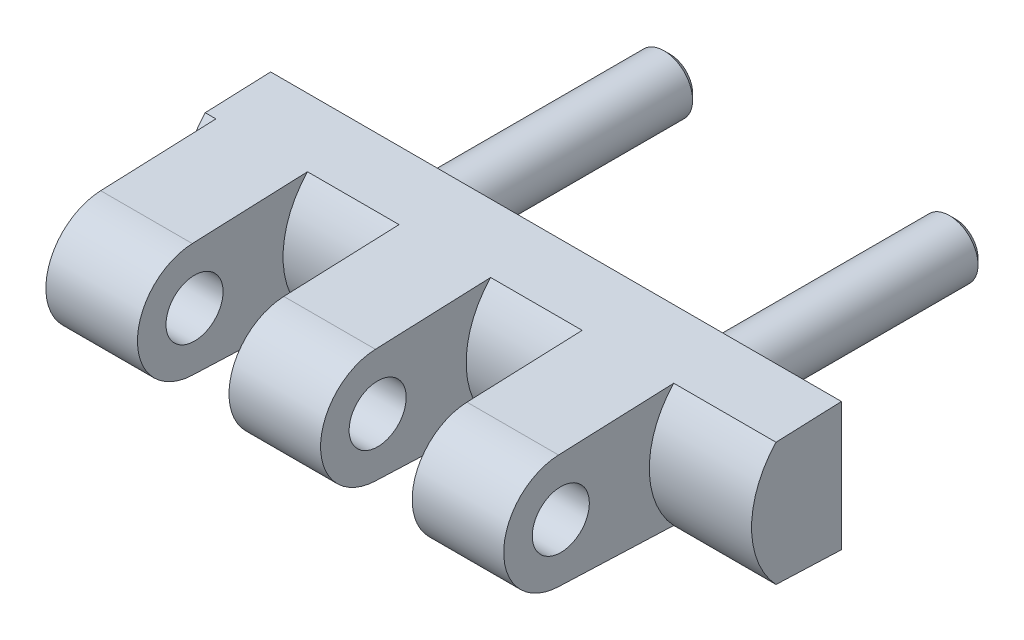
ISO-10303-21;
HEADER;
FILE_DESCRIPTION(('STEP AP214'),'2;1');
FILE_NAME('part.step','',(''),(''),'','','');
FILE_SCHEMA(('AUTOMOTIVE_DESIGN { 1 0 10303 214 1 1 1 1 }'));
ENDSEC;
DATA;
#1=APPLICATION_CONTEXT('core data for automotive mechanical design processes');
#2=APPLICATION_PROTOCOL_DEFINITION('international standard','automotive_design',2000,#1);
#3=PRODUCT_CONTEXT('',#1,'mechanical');
#4=PRODUCT('Part','Part','',(#3));
#5=PRODUCT_RELATED_PRODUCT_CATEGORY('part','',(#4));
#6=PRODUCT_DEFINITION_FORMATION('','',#4);
#7=PRODUCT_DEFINITION_CONTEXT('part definition',#1,'design');
#8=PRODUCT_DEFINITION('design','',#6,#7);
#9=PRODUCT_DEFINITION_SHAPE('','',#8);
#10=(LENGTH_UNIT() NAMED_UNIT(*) SI_UNIT(.MILLI.,.METRE.));
#11=(NAMED_UNIT(*) PLANE_ANGLE_UNIT() SI_UNIT($,.RADIAN.));
#12=(NAMED_UNIT(*) SI_UNIT($,.STERADIAN.) SOLID_ANGLE_UNIT());
#13=UNCERTAINTY_MEASURE_WITH_UNIT(LENGTH_MEASURE(1.E-05),#10,'distance_accuracy_value','');
#14=(GEOMETRIC_REPRESENTATION_CONTEXT(3) GLOBAL_UNCERTAINTY_ASSIGNED_CONTEXT((#13)) GLOBAL_UNIT_ASSIGNED_CONTEXT((#10,
#11,#12)) REPRESENTATION_CONTEXT('',''));
#15=CARTESIAN_POINT('',(0.,0.,0.));
#16=DIRECTION('',(0.,0.,1.));
#17=DIRECTION('',(1.,0.,0.));
#18=AXIS2_PLACEMENT_3D('',#15,#16,#17);
#19=CARTESIAN_POINT('',(-10.25,-4.5,0.));
#20=DIRECTION('',(0.,-0.99921100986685,0.0397159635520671));
#21=DIRECTION('',(0.,0.0397159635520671,0.999211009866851));
#22=AXIS2_PLACEMENT_3D('',#19,#20,#21);
#23=PLANE('',#22);
#24=DIRECTION('',(1.,0.,0.));
#25=VECTOR('',#24,1.);
#26=CARTESIAN_POINT('',(-40.,-4.31777704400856,4.58453396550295));
#27=LINE('',#26,#25);
#28=CARTESIAN_POINT('',(-10.,-4.31777704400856,4.58453396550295));
#29=VERTEX_POINT('',#28);
#30=CARTESIAN_POINT('',(-9.25,-4.31777704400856,4.58453396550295));
#31=VERTEX_POINT('',#30);
#32=EDGE_CURVE('E176',#29,#31,#27,.T.);
#33=ORIENTED_EDGE('',*,*,#32,.F.);
#34=DIRECTION('',(0.,0.0397159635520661,0.99921100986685));
#35=VECTOR('',#34,1.);
#36=CARTESIAN_POINT('',(-10.,-4.5,0.));
#37=LINE('',#36,#35);
#38=CARTESIAN_POINT('',(-10.,-4.5,0.));
#39=VERTEX_POINT('',#38);
#40=EDGE_CURVE('E29',#39,#29,#37,.T.);
#41=ORIENTED_EDGE('',*,*,#40,.F.);
#42=DIRECTION('',(1.,0.,0.));
#43=VECTOR('',#42,1.);
#44=CARTESIAN_POINT('',(-10.25,-4.5,0.));
#45=LINE('',#44,#43);
#46=CARTESIAN_POINT('',(30.,-4.5,0.));
#47=VERTEX_POINT('',#46);
#48=EDGE_CURVE('E203',#39,#47,#45,.T.);
#49=ORIENTED_EDGE('',*,*,#48,.T.);
#50=DIRECTION('',(0.,-0.0397159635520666,-0.99921100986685));
#51=VECTOR('',#50,1.);
#52=CARTESIAN_POINT('',(30.,-4.31777704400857,4.58453396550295));
#53=LINE('',#52,#51);
#54=CARTESIAN_POINT('',(30.,-4.31777704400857,4.58453396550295));
#55=VERTEX_POINT('',#54);
#56=EDGE_CURVE('E787',#55,#47,#53,.T.);
#57=ORIENTED_EDGE('',*,*,#56,.F.);
#58=DIRECTION('',(1.,0.,0.));
#59=VECTOR('',#58,1.);
#60=CARTESIAN_POINT('',(-40.,-4.31777704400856,4.58453396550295));
#61=LINE('',#60,#59);
#62=CARTESIAN_POINT('',(22.833333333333,-4.31777704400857,4.58453396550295));
#63=VERTEX_POINT('',#62);
#64=EDGE_CURVE('E173',#63,#55,#61,.T.);
#65=ORIENTED_EDGE('',*,*,#64,.F.);
#66=DIRECTION('',(0.,-0.0397159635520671,-0.999211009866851));
#67=VECTOR('',#66,1.);
#68=CARTESIAN_POINT('',(22.833333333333,-4.5,0.));
#69=LINE('',#68,#67);
#70=CARTESIAN_POINT('',(22.833333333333,-3.9968440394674,12.658863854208));
#71=VERTEX_POINT('',#70);
#72=EDGE_CURVE('E192',#71,#63,#69,.T.);
#73=ORIENTED_EDGE('',*,*,#72,.F.);
#74=DIRECTION('',(1.,0.,0.));
#75=VECTOR('',#74,1.);
#76=CARTESIAN_POINT('',(-10.25,-3.9968440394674,12.658863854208));
#77=LINE('',#76,#75);
#78=CARTESIAN_POINT('',(16.4166666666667,-3.9968440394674,12.658863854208));
#79=VERTEX_POINT('',#78);
#80=EDGE_CURVE('E199',#79,#71,#77,.T.);
#81=ORIENTED_EDGE('',*,*,#80,.F.);
#82=DIRECTION('',(0.,0.0397159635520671,0.999211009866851));
#83=VECTOR('',#82,1.);
#84=CARTESIAN_POINT('',(16.4166666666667,-4.5,0.));
#85=LINE('',#84,#83);
#86=CARTESIAN_POINT('',(16.4166666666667,-4.31777704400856,4.58453396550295));
#87=VERTEX_POINT('',#86);
#88=EDGE_CURVE('E189',#87,#79,#85,.T.);
#89=ORIENTED_EDGE('',*,*,#88,.F.);
#90=DIRECTION('',(1.,0.,0.));
#91=VECTOR('',#90,1.);
#92=CARTESIAN_POINT('',(-40.,-4.31777704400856,4.58453396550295));
#93=LINE('',#92,#91);
#94=CARTESIAN_POINT('',(10.,-4.31777704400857,4.58453396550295));
#95=VERTEX_POINT('',#94);
#96=EDGE_CURVE('E226',#95,#87,#93,.T.);
#97=ORIENTED_EDGE('',*,*,#96,.F.);
#98=DIRECTION('',(0.,-0.0397159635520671,-0.999211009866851));
#99=VECTOR('',#98,1.);
#100=CARTESIAN_POINT('',(10.,-4.5,0.));
#101=LINE('',#100,#99);
#102=CARTESIAN_POINT('',(10.,-3.9968440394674,12.658863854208));
#103=VERTEX_POINT('',#102);
#104=EDGE_CURVE('E186',#103,#95,#101,.T.);
#105=ORIENTED_EDGE('',*,*,#104,.F.);
#106=CARTESIAN_POINT('',(3.5833333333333,-3.9968440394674,12.658863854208));
#107=VERTEX_POINT('',#106);
#108=EDGE_CURVE('E201',#107,#103,#77,.T.);
#109=ORIENTED_EDGE('',*,*,#108,.F.);
#110=DIRECTION('',(0.,0.0397159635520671,0.999211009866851));
#111=VECTOR('',#110,1.);
#112=CARTESIAN_POINT('',(3.5833333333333,-4.5,0.));
#113=LINE('',#112,#111);
#114=CARTESIAN_POINT('',(3.5833333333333,-4.31777704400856,4.58453396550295));
#115=VERTEX_POINT('',#114);
#116=EDGE_CURVE('E184',#115,#107,#113,.T.);
#117=ORIENTED_EDGE('',*,*,#116,.F.);
#118=DIRECTION('',(1.,0.,0.));
#119=VECTOR('',#118,1.);
#120=CARTESIAN_POINT('',(-40.,-4.31777704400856,4.58453396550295));
#121=LINE('',#120,#119);
#122=CARTESIAN_POINT('',(-2.833333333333,-4.31777704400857,4.58453396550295));
#123=VERTEX_POINT('',#122);
#124=EDGE_CURVE('E223',#123,#115,#121,.T.);
#125=ORIENTED_EDGE('',*,*,#124,.F.);
#126=DIRECTION('',(0.,-0.0397159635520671,-0.999211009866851));
#127=VECTOR('',#126,1.);
#128=CARTESIAN_POINT('',(-2.833333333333,-4.5,0.));
#129=LINE('',#128,#127);
#130=CARTESIAN_POINT('',(-2.833333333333,-3.9968440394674,12.658863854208));
#131=VERTEX_POINT('',#130);
#132=EDGE_CURVE('E181',#131,#123,#129,.T.);
#133=ORIENTED_EDGE('',*,*,#132,.F.);
#134=CARTESIAN_POINT('',(-9.25,-3.9968440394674,12.658863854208));
#135=VERTEX_POINT('',#134);
#136=EDGE_CURVE('E202',#135,#131,#77,.T.);
#137=ORIENTED_EDGE('',*,*,#136,.F.);
#138=DIRECTION('',(0.,0.0397159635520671,0.999211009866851));
#139=VECTOR('',#138,1.);
#140=CARTESIAN_POINT('',(-9.25,-4.5,0.));
#141=LINE('',#140,#139);
#142=EDGE_CURVE('E178',#31,#135,#141,.T.);
#143=ORIENTED_EDGE('',*,*,#142,.F.);
#144=EDGE_LOOP('',(#33,#41,#49,#57,#65,#73,#81,#89,#97,#105,#109,#117,#125,#133,#137,#143));
#145=FACE_BOUND('',#144,.T.);
#146=ADVANCED_FACE('F14',(#145),#23,.T.);
#147=CARTESIAN_POINT('',(-10.25,3.9968440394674,12.658863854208));
#148=DIRECTION('',(0.,0.99921100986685,0.0397159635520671));
#149=DIRECTION('',(0.,0.0397159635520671,-0.999211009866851));
#150=AXIS2_PLACEMENT_3D('',#147,#148,#149);
#151=PLANE('',#150);
#152=DIRECTION('',(1.,0.,0.));
#153=VECTOR('',#152,1.);
#154=CARTESIAN_POINT('',(-10.25,4.5,0.));
#155=LINE('',#154,#153);
#156=CARTESIAN_POINT('',(-10.,4.5,0.));
#157=VERTEX_POINT('',#156);
#158=CARTESIAN_POINT('',(30.,4.5,0.));
#159=VERTEX_POINT('',#158);
#160=EDGE_CURVE('E138',#157,#159,#155,.T.);
#161=ORIENTED_EDGE('',*,*,#160,.F.);
#162=DIRECTION('',(0.,0.0397159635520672,-0.99921100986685));
#163=VECTOR('',#162,1.);
#164=CARTESIAN_POINT('',(-10.,4.31777704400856,4.58453396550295));
#165=LINE('',#164,#163);
#166=CARTESIAN_POINT('',(-10.,4.31777704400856,4.58453396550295));
#167=VERTEX_POINT('',#166);
#168=EDGE_CURVE('E128',#167,#157,#165,.T.);
#169=ORIENTED_EDGE('',*,*,#168,.F.);
#170=DIRECTION('',(-1.,0.,0.));
#171=VECTOR('',#170,1.);
#172=CARTESIAN_POINT('',(-40.,4.31777704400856,4.58453396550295));
#173=LINE('',#172,#171);
#174=CARTESIAN_POINT('',(-9.25,4.31777704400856,4.58453396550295));
#175=VERTEX_POINT('',#174);
#176=EDGE_CURVE('E136',#167,#175,#173,.F.);
#177=ORIENTED_EDGE('',*,*,#176,.T.);
#178=DIRECTION('',(0.,-0.0397159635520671,0.999211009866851));
#179=VECTOR('',#178,1.);
#180=CARTESIAN_POINT('',(-9.25,3.9968440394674,12.658863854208));
#181=LINE('',#180,#179);
#182=CARTESIAN_POINT('',(-9.25,3.9968440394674,12.658863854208));
#183=VERTEX_POINT('',#182);
#184=EDGE_CURVE('E145',#175,#183,#181,.T.);
#185=ORIENTED_EDGE('',*,*,#184,.T.);
#186=DIRECTION('',(1.,0.,0.));
#187=VECTOR('',#186,1.);
#188=CARTESIAN_POINT('',(-10.25,3.9968440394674,12.658863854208));
#189=LINE('',#188,#187);
#190=CARTESIAN_POINT('',(-2.833333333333,3.9968440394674,12.658863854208));
#191=VERTEX_POINT('',#190);
#192=EDGE_CURVE('E198',#183,#191,#189,.T.);
#193=ORIENTED_EDGE('',*,*,#192,.T.);
#194=DIRECTION('',(0.,0.0397159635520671,-0.999211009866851));
#195=VECTOR('',#194,1.);
#196=CARTESIAN_POINT('',(-2.833333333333,3.9968440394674,12.658863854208));
#197=LINE('',#196,#195);
#198=CARTESIAN_POINT('',(-2.833333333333,4.31777704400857,4.58453396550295));
#199=VERTEX_POINT('',#198);
#200=EDGE_CURVE('E747',#191,#199,#197,.T.);
#201=ORIENTED_EDGE('',*,*,#200,.T.);
#202=DIRECTION('',(-1.,0.,0.));
#203=VECTOR('',#202,1.);
#204=CARTESIAN_POINT('',(-40.,4.31777704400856,4.58453396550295));
#205=LINE('',#204,#203);
#206=CARTESIAN_POINT('',(3.5833333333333,4.31777704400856,4.58453396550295));
#207=VERTEX_POINT('',#206);
#208=EDGE_CURVE('E146',#199,#207,#205,.F.);
#209=ORIENTED_EDGE('',*,*,#208,.T.);
#210=DIRECTION('',(0.,-0.0397159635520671,0.999211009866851));
#211=VECTOR('',#210,1.);
#212=CARTESIAN_POINT('',(3.5833333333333,3.9968440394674,12.658863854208));
#213=LINE('',#212,#211);
#214=CARTESIAN_POINT('',(3.5833333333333,3.9968440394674,12.658863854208));
#215=VERTEX_POINT('',#214);
#216=EDGE_CURVE('E151',#207,#215,#213,.T.);
#217=ORIENTED_EDGE('',*,*,#216,.T.);
#218=CARTESIAN_POINT('',(10.,3.9968440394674,12.658863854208));
#219=VERTEX_POINT('',#218);
#220=EDGE_CURVE('E197',#215,#219,#189,.T.);
#221=ORIENTED_EDGE('',*,*,#220,.T.);
#222=DIRECTION('',(0.,0.0397159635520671,-0.999211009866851));
#223=VECTOR('',#222,1.);
#224=CARTESIAN_POINT('',(10.,3.9968440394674,12.658863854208));
#225=LINE('',#224,#223);
#226=CARTESIAN_POINT('',(10.,4.31777704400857,4.58453396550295));
#227=VERTEX_POINT('',#226);
#228=EDGE_CURVE('E741',#219,#227,#225,.T.);
#229=ORIENTED_EDGE('',*,*,#228,.T.);
#230=DIRECTION('',(-1.,0.,0.));
#231=VECTOR('',#230,1.);
#232=CARTESIAN_POINT('',(-40.,4.31777704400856,4.58453396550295));
#233=LINE('',#232,#231);
#234=CARTESIAN_POINT('',(16.4166666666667,4.31777704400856,4.58453396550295));
#235=VERTEX_POINT('',#234);
#236=EDGE_CURVE('E739',#227,#235,#233,.F.);
#237=ORIENTED_EDGE('',*,*,#236,.T.);
#238=DIRECTION('',(0.,-0.0397159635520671,0.999211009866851));
#239=VECTOR('',#238,1.);
#240=CARTESIAN_POINT('',(16.4166666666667,3.9968440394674,12.658863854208));
#241=LINE('',#240,#239);
#242=CARTESIAN_POINT('',(16.4166666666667,3.9968440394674,12.658863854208));
#243=VERTEX_POINT('',#242);
#244=EDGE_CURVE('E744',#235,#243,#241,.T.);
#245=ORIENTED_EDGE('',*,*,#244,.T.);
#246=CARTESIAN_POINT('',(22.833333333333,3.9968440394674,12.658863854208));
#247=VERTEX_POINT('',#246);
#248=EDGE_CURVE('E195',#243,#247,#189,.T.);
#249=ORIENTED_EDGE('',*,*,#248,.T.);
#250=DIRECTION('',(0.,0.0397159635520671,-0.999211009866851));
#251=VECTOR('',#250,1.);
#252=CARTESIAN_POINT('',(22.833333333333,3.9968440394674,12.658863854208));
#253=LINE('',#252,#251);
#254=CARTESIAN_POINT('',(22.833333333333,4.31777704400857,4.58453396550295));
#255=VERTEX_POINT('',#254);
#256=EDGE_CURVE('E157',#247,#255,#253,.T.);
#257=ORIENTED_EDGE('',*,*,#256,.T.);
#258=DIRECTION('',(-1.,0.,0.));
#259=VECTOR('',#258,1.);
#260=CARTESIAN_POINT('',(-40.,4.31777704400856,4.58453396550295));
#261=LINE('',#260,#259);
#262=CARTESIAN_POINT('',(30.,4.31777704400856,4.58453396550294));
#263=VERTEX_POINT('',#262);
#264=EDGE_CURVE('E148',#255,#263,#261,.F.);
#265=ORIENTED_EDGE('',*,*,#264,.T.);
#266=DIRECTION('',(0.,-0.0397159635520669,0.99921100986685));
#267=VECTOR('',#266,1.);
#268=CARTESIAN_POINT('',(30.,4.5,0.));
#269=LINE('',#268,#267);
#270=EDGE_CURVE('E37',#159,#263,#269,.T.);
#271=ORIENTED_EDGE('',*,*,#270,.F.);
#272=EDGE_LOOP('',(#161,#169,#177,#185,#193,#201,#209,#217,#221,#229,#237,#245,#249,#257,#265,#271));
#273=FACE_BOUND('',#272,.T.);
#274=ADVANCED_FACE('F16',(#273),#151,.T.);
#275=CARTESIAN_POINT('',(-10.25,4.5,0.));
#276=DIRECTION('',(0.,0.,-1.));
#277=DIRECTION('',(-1.,0.,0.));
#278=AXIS2_PLACEMENT_3D('',#275,#276,#277);
#279=PLANE('',#278);
#280=CARTESIAN_POINT('',(0.,0.,0.));
#281=DIRECTION('',(0.,0.,1.));
#282=DIRECTION('',(-1.,0.,0.));
#283=AXIS2_PLACEMENT_3D('',#280,#281,#282);
#284=CIRCLE('',#283,2.);
#285=CARTESIAN_POINT('',(-2.,0.,0.));
#286=VERTEX_POINT('',#285);
#287=EDGE_CURVE('E9',#286,#286,#284,.T.);
#288=ORIENTED_EDGE('',*,*,#287,.T.);
#289=EDGE_LOOP('',(#288));
#290=FACE_BOUND('',#289,.T.);
#291=CARTESIAN_POINT('',(20.,0.,0.));
#292=DIRECTION('',(0.,0.,1.));
#293=DIRECTION('',(-1.,0.,0.));
#294=AXIS2_PLACEMENT_3D('',#291,#292,#293);
#295=CIRCLE('',#294,2.);
#296=CARTESIAN_POINT('',(18.,0.,0.));
#297=VERTEX_POINT('',#296);
#298=EDGE_CURVE('E22',#297,#297,#295,.T.);
#299=ORIENTED_EDGE('',*,*,#298,.T.);
#300=EDGE_LOOP('',(#299));
#301=FACE_BOUND('',#300,.T.);
#302=ORIENTED_EDGE('',*,*,#48,.F.);
#303=DIRECTION('',(0.,-1.,0.));
#304=VECTOR('',#303,1.);
#305=CARTESIAN_POINT('',(-10.,4.5,0.));
#306=LINE('',#305,#304);
#307=EDGE_CURVE('E139',#157,#39,#306,.T.);
#308=ORIENTED_EDGE('',*,*,#307,.F.);
#309=ORIENTED_EDGE('',*,*,#160,.T.);
#310=DIRECTION('',(0.,1.,0.));
#311=VECTOR('',#310,1.);
#312=CARTESIAN_POINT('',(30.,-4.5,0.));
#313=LINE('',#312,#311);
#314=EDGE_CURVE('E782',#47,#159,#313,.T.);
#315=ORIENTED_EDGE('',*,*,#314,.F.);
#316=EDGE_LOOP('',(#302,#308,#309,#315));
#317=FACE_BOUND('',#316,.T.);
#318=ADVANCED_FACE('F230',(#290,#301,#317),#279,.T.);
#319=CARTESIAN_POINT('',(-40.,0.,0.));
#320=DIRECTION('',(1.,0.,0.));
#321=DIRECTION('',(0.,-1.,0.));
#322=AXIS2_PLACEMENT_3D('',#319,#320,#321);
#323=CYLINDRICAL_SURFACE('',#322,6.2977099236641);
#324=ORIENTED_EDGE('',*,*,#176,.F.);
#325=CARTESIAN_POINT('',(-10.,0.,0.));
#326=DIRECTION('',(-1.,0.,0.));
#327=DIRECTION('',(0.,0.,1.));
#328=AXIS2_PLACEMENT_3D('',#325,#326,#327);
#329=CIRCLE('',#328,6.29770992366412);
#330=EDGE_CURVE('E125',#29,#167,#329,.T.);
#331=ORIENTED_EDGE('',*,*,#330,.F.);
#332=ORIENTED_EDGE('',*,*,#32,.T.);
#333=CARTESIAN_POINT('',(-9.25,0.,0.));
#334=DIRECTION('',(-1.,0.,0.));
#335=DIRECTION('',(0.,-1.,0.));
#336=AXIS2_PLACEMENT_3D('',#333,#334,#335);
#337=CIRCLE('',#336,6.2977099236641);
#338=EDGE_CURVE('E143',#31,#175,#337,.T.);
#339=ORIENTED_EDGE('',*,*,#338,.T.);
#340=EDGE_LOOP('',(#324,#331,#332,#339));
#341=FACE_BOUND('',#340,.T.);
#342=ADVANCED_FACE('F141',(#341),#323,.T.);
#343=CARTESIAN_POINT('',(-40.,0.,0.));
#344=DIRECTION('',(1.,0.,0.));
#345=DIRECTION('',(0.,-1.,0.));
#346=AXIS2_PLACEMENT_3D('',#343,#344,#345);
#347=CYLINDRICAL_SURFACE('',#346,6.2977099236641);
#348=ORIENTED_EDGE('',*,*,#64,.T.);
#349=CARTESIAN_POINT('',(30.,0.,0.));
#350=DIRECTION('',(1.,0.,0.));
#351=DIRECTION('',(0.,0.,-1.));
#352=AXIS2_PLACEMENT_3D('',#349,#350,#351);
#353=CIRCLE('',#352,6.29770992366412);
#354=EDGE_CURVE('E780',#263,#55,#353,.T.);
#355=ORIENTED_EDGE('',*,*,#354,.F.);
#356=ORIENTED_EDGE('',*,*,#264,.F.);
#357=CARTESIAN_POINT('',(22.833333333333,0.,0.));
#358=DIRECTION('',(-1.,0.,0.));
#359=DIRECTION('',(0.,-1.,0.));
#360=AXIS2_PLACEMENT_3D('',#357,#358,#359);
#361=CIRCLE('',#360,6.2977099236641);
#362=EDGE_CURVE('E170',#63,#255,#361,.T.);
#363=ORIENTED_EDGE('',*,*,#362,.F.);
#364=EDGE_LOOP('',(#348,#355,#356,#363));
#365=FACE_BOUND('',#364,.T.);
#366=ADVANCED_FACE('F268',(#365),#347,.T.);
#367=CARTESIAN_POINT('',(22.833333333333,-6.2977099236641,0.));
#368=DIRECTION('',(1.,0.,0.));
#369=DIRECTION('',(0.,-1.,0.));
#370=AXIS2_PLACEMENT_3D('',#367,#368,#369);
#371=PLANE('',#370);
#372=CARTESIAN_POINT('',(22.833333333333,0.,12.5));
#373=DIRECTION('',(-1.,0.,0.));
#374=DIRECTION('',(0.,-1.,0.));
#375=AXIS2_PLACEMENT_3D('',#372,#373,#374);
#376=CIRCLE('',#375,4.);
#377=EDGE_CURVE('E220',#247,#71,#376,.F.);
#378=ORIENTED_EDGE('',*,*,#377,.T.);
#379=ORIENTED_EDGE('',*,*,#72,.T.);
#380=ORIENTED_EDGE('',*,*,#362,.T.);
#381=ORIENTED_EDGE('',*,*,#256,.F.);
#382=EDGE_LOOP('',(#378,#379,#380,#381));
#383=FACE_BOUND('',#382,.T.);
#384=CARTESIAN_POINT('',(22.833333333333,0.,12.5));
#385=DIRECTION('',(-1.,0.,0.));
#386=DIRECTION('',(0.,-1.,0.));
#387=AXIS2_PLACEMENT_3D('',#384,#385,#386);
#388=CIRCLE('',#387,2.);
#389=CARTESIAN_POINT('',(22.833333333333,-2.,12.5));
#390=VERTEX_POINT('',#389);
#391=EDGE_CURVE('E723',#390,#390,#388,.F.);
#392=ORIENTED_EDGE('',*,*,#391,.F.);
#393=EDGE_LOOP('',(#392));
#394=FACE_BOUND('',#393,.T.);
#395=ADVANCED_FACE('F476',(#383,#394),#371,.T.);
#396=CARTESIAN_POINT('',(16.4166666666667,-19.8,0.));
#397=DIRECTION('',(-1.,0.,0.));
#398=DIRECTION('',(0.,1.,0.));
#399=AXIS2_PLACEMENT_3D('',#396,#397,#398);
#400=PLANE('',#399);
#401=CARTESIAN_POINT('',(16.4166666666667,0.,0.));
#402=DIRECTION('',(-1.,0.,0.));
#403=DIRECTION('',(0.,-1.,0.));
#404=AXIS2_PLACEMENT_3D('',#401,#402,#403);
#405=CIRCLE('',#404,6.2977099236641);
#406=EDGE_CURVE('E167',#87,#235,#405,.T.);
#407=ORIENTED_EDGE('',*,*,#406,.F.);
#408=ORIENTED_EDGE('',*,*,#88,.T.);
#409=CARTESIAN_POINT('',(16.4166666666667,0.,12.5));
#410=DIRECTION('',(1.,0.,0.));
#411=DIRECTION('',(0.,1.,0.));
#412=AXIS2_PLACEMENT_3D('',#409,#410,#411);
#413=CIRCLE('',#412,4.);
#414=EDGE_CURVE('E217',#79,#243,#413,.F.);
#415=ORIENTED_EDGE('',*,*,#414,.T.);
#416=ORIENTED_EDGE('',*,*,#244,.F.);
#417=EDGE_LOOP('',(#407,#408,#415,#416));
#418=FACE_BOUND('',#417,.T.);
#419=CARTESIAN_POINT('',(16.4166666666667,0.,12.5));
#420=DIRECTION('',(1.,0.,0.));
#421=DIRECTION('',(0.,1.,0.));
#422=AXIS2_PLACEMENT_3D('',#419,#420,#421);
#423=CIRCLE('',#422,2.);
#424=CARTESIAN_POINT('',(16.4166666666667,2.,12.5));
#425=VERTEX_POINT('',#424);
#426=EDGE_CURVE('E730',#425,#425,#423,.F.);
#427=ORIENTED_EDGE('',*,*,#426,.F.);
#428=EDGE_LOOP('',(#427));
#429=FACE_BOUND('',#428,.T.);
#430=ADVANCED_FACE('F466',(#418,#429),#400,.T.);
#431=CARTESIAN_POINT('',(-10.25,0.,12.5));
#432=DIRECTION('',(1.,0.,0.));
#433=DIRECTION('',(0.,-1.,0.));
#434=AXIS2_PLACEMENT_3D('',#431,#432,#433);
#435=CYLINDRICAL_SURFACE('',#434,4.);
#436=ORIENTED_EDGE('',*,*,#248,.F.);
#437=ORIENTED_EDGE('',*,*,#414,.F.);
#438=ORIENTED_EDGE('',*,*,#80,.T.);
#439=ORIENTED_EDGE('',*,*,#377,.F.);
#440=EDGE_LOOP('',(#436,#437,#438,#439));
#441=FACE_BOUND('',#440,.T.);
#442=ADVANCED_FACE('F448',(#441),#435,.T.);
#443=ORIENTED_EDGE('',*,*,#220,.F.);
#444=CARTESIAN_POINT('',(3.5833333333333,0.,12.5));
#445=DIRECTION('',(1.,0.,0.));
#446=DIRECTION('',(0.,1.,0.));
#447=AXIS2_PLACEMENT_3D('',#444,#445,#446);
#448=CIRCLE('',#447,4.);
#449=EDGE_CURVE('E211',#107,#215,#448,.F.);
#450=ORIENTED_EDGE('',*,*,#449,.F.);
#451=ORIENTED_EDGE('',*,*,#108,.T.);
#452=CARTESIAN_POINT('',(10.,0.,12.5));
#453=DIRECTION('',(-1.,0.,0.));
#454=DIRECTION('',(0.,-1.,0.));
#455=AXIS2_PLACEMENT_3D('',#452,#453,#454);
#456=CIRCLE('',#455,4.);
#457=EDGE_CURVE('E214',#219,#103,#456,.F.);
#458=ORIENTED_EDGE('',*,*,#457,.F.);
#459=EDGE_LOOP('',(#443,#450,#451,#458));
#460=FACE_BOUND('',#459,.T.);
#461=ADVANCED_FACE('F446',(#460),#435,.T.);
#462=ORIENTED_EDGE('',*,*,#192,.F.);
#463=CARTESIAN_POINT('',(-9.25,0.,12.5));
#464=DIRECTION('',(1.,0.,0.));
#465=DIRECTION('',(0.,1.,0.));
#466=AXIS2_PLACEMENT_3D('',#463,#464,#465);
#467=CIRCLE('',#466,4.);
#468=EDGE_CURVE('E206',#135,#183,#467,.F.);
#469=ORIENTED_EDGE('',*,*,#468,.F.);
#470=ORIENTED_EDGE('',*,*,#136,.T.);
#471=CARTESIAN_POINT('',(-2.833333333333,0.,12.5));
#472=DIRECTION('',(-1.,0.,0.));
#473=DIRECTION('',(0.,-1.,0.));
#474=AXIS2_PLACEMENT_3D('',#471,#472,#473);
#475=CIRCLE('',#474,4.);
#476=EDGE_CURVE('E209',#191,#131,#475,.F.);
#477=ORIENTED_EDGE('',*,*,#476,.F.);
#478=EDGE_LOOP('',(#462,#469,#470,#477));
#479=FACE_BOUND('',#478,.T.);
#480=ADVANCED_FACE('F260',(#479),#435,.T.);
#481=CARTESIAN_POINT('',(-9.25,-19.8,0.));
#482=DIRECTION('',(-1.,0.,0.));
#483=DIRECTION('',(0.,1.,0.));
#484=AXIS2_PLACEMENT_3D('',#481,#482,#483);
#485=PLANE('',#484);
#486=CARTESIAN_POINT('',(-9.25,0.,12.5));
#487=DIRECTION('',(1.,0.,0.));
#488=DIRECTION('',(0.,1.,0.));
#489=AXIS2_PLACEMENT_3D('',#486,#487,#488);
#490=CIRCLE('',#489,2.);
#491=CARTESIAN_POINT('',(-9.25,2.,12.5));
#492=VERTEX_POINT('',#491);
#493=EDGE_CURVE('E736',#492,#492,#490,.T.);
#494=ORIENTED_EDGE('',*,*,#493,.T.);
#495=EDGE_LOOP('',(#494));
#496=FACE_BOUND('',#495,.T.);
#497=ORIENTED_EDGE('',*,*,#338,.F.);
#498=ORIENTED_EDGE('',*,*,#142,.T.);
#499=ORIENTED_EDGE('',*,*,#468,.T.);
#500=ORIENTED_EDGE('',*,*,#184,.F.);
#501=EDGE_LOOP('',(#497,#498,#499,#500));
#502=FACE_BOUND('',#501,.T.);
#503=ADVANCED_FACE('F425',(#496,#502),#485,.T.);
#504=CARTESIAN_POINT('',(-2.833333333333,-6.2977099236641,0.));
#505=DIRECTION('',(1.,0.,0.));
#506=DIRECTION('',(0.,-1.,0.));
#507=AXIS2_PLACEMENT_3D('',#504,#505,#506);
#508=PLANE('',#507);
#509=CARTESIAN_POINT('',(-2.833333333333,0.,12.5));
#510=DIRECTION('',(-1.,0.,0.));
#511=DIRECTION('',(0.,-1.,0.));
#512=AXIS2_PLACEMENT_3D('',#509,#510,#511);
#513=CIRCLE('',#512,2.);
#514=CARTESIAN_POINT('',(-2.833333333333,-2.,12.5));
#515=VERTEX_POINT('',#514);
#516=EDGE_CURVE('E727',#515,#515,#513,.T.);
#517=ORIENTED_EDGE('',*,*,#516,.T.);
#518=EDGE_LOOP('',(#517));
#519=FACE_BOUND('',#518,.T.);
#520=ORIENTED_EDGE('',*,*,#476,.T.);
#521=ORIENTED_EDGE('',*,*,#132,.T.);
#522=CARTESIAN_POINT('',(-2.833333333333,0.,0.));
#523=DIRECTION('',(-1.,0.,0.));
#524=DIRECTION('',(0.,-1.,0.));
#525=AXIS2_PLACEMENT_3D('',#522,#523,#524);
#526=CIRCLE('',#525,6.2977099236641);
#527=EDGE_CURVE('E161',#123,#199,#526,.T.);
#528=ORIENTED_EDGE('',*,*,#527,.T.);
#529=ORIENTED_EDGE('',*,*,#200,.F.);
#530=EDGE_LOOP('',(#520,#521,#528,#529));
#531=FACE_BOUND('',#530,.T.);
#532=ADVANCED_FACE('F414',(#519,#531),#508,.T.);
#533=CARTESIAN_POINT('',(3.5833333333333,-19.8,0.));
#534=DIRECTION('',(-1.,0.,0.));
#535=DIRECTION('',(0.,1.,0.));
#536=AXIS2_PLACEMENT_3D('',#533,#534,#535);
#537=PLANE('',#536);
#538=CARTESIAN_POINT('',(3.5833333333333,0.,12.5));
#539=DIRECTION('',(1.,0.,0.));
#540=DIRECTION('',(0.,1.,0.));
#541=AXIS2_PLACEMENT_3D('',#538,#539,#540);
#542=CIRCLE('',#541,2.);
#543=CARTESIAN_POINT('',(3.5833333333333,2.,12.5));
#544=VERTEX_POINT('',#543);
#545=EDGE_CURVE('E722',#544,#544,#542,.T.);
#546=ORIENTED_EDGE('',*,*,#545,.T.);
#547=EDGE_LOOP('',(#546));
#548=FACE_BOUND('',#547,.T.);
#549=CARTESIAN_POINT('',(3.5833333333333,0.,0.));
#550=DIRECTION('',(-1.,0.,0.));
#551=DIRECTION('',(0.,-1.,0.));
#552=AXIS2_PLACEMENT_3D('',#549,#550,#551);
#553=CIRCLE('',#552,6.2977099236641);
#554=EDGE_CURVE('E163',#115,#207,#553,.T.);
#555=ORIENTED_EDGE('',*,*,#554,.F.);
#556=ORIENTED_EDGE('',*,*,#116,.T.);
#557=ORIENTED_EDGE('',*,*,#449,.T.);
#558=ORIENTED_EDGE('',*,*,#216,.F.);
#559=EDGE_LOOP('',(#555,#556,#557,#558));
#560=FACE_BOUND('',#559,.T.);
#561=ADVANCED_FACE('F403',(#548,#560),#537,.T.);
#562=CARTESIAN_POINT('',(-40.,0.,0.));
#563=DIRECTION('',(1.,0.,0.));
#564=DIRECTION('',(0.,-1.,0.));
#565=AXIS2_PLACEMENT_3D('',#562,#563,#564);
#566=CYLINDRICAL_SURFACE('',#565,6.2977099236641);
#567=ORIENTED_EDGE('',*,*,#527,.F.);
#568=ORIENTED_EDGE('',*,*,#124,.T.);
#569=ORIENTED_EDGE('',*,*,#554,.T.);
#570=ORIENTED_EDGE('',*,*,#208,.F.);
#571=EDGE_LOOP('',(#567,#568,#569,#570));
#572=FACE_BOUND('',#571,.T.);
#573=ADVANCED_FACE('F392',(#572),#566,.T.);
#574=CARTESIAN_POINT('',(-40.,0.,0.));
#575=DIRECTION('',(1.,0.,0.));
#576=DIRECTION('',(0.,-1.,0.));
#577=AXIS2_PLACEMENT_3D('',#574,#575,#576);
#578=CYLINDRICAL_SURFACE('',#577,6.2977099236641);
#579=CARTESIAN_POINT('',(10.,0.,0.));
#580=DIRECTION('',(-1.,0.,0.));
#581=DIRECTION('',(0.,-1.,0.));
#582=AXIS2_PLACEMENT_3D('',#579,#580,#581);
#583=CIRCLE('',#582,6.2977099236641);
#584=EDGE_CURVE('E165',#95,#227,#583,.T.);
#585=ORIENTED_EDGE('',*,*,#584,.F.);
#586=ORIENTED_EDGE('',*,*,#96,.T.);
#587=ORIENTED_EDGE('',*,*,#406,.T.);
#588=ORIENTED_EDGE('',*,*,#236,.F.);
#589=EDGE_LOOP('',(#585,#586,#587,#588));
#590=FACE_BOUND('',#589,.T.);
#591=ADVANCED_FACE('F381',(#590),#578,.T.);
#592=CARTESIAN_POINT('',(10.,-6.2977099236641,0.));
#593=DIRECTION('',(1.,0.,0.));
#594=DIRECTION('',(0.,-1.,0.));
#595=AXIS2_PLACEMENT_3D('',#592,#593,#594);
#596=PLANE('',#595);
#597=CARTESIAN_POINT('',(10.,0.,12.5));
#598=DIRECTION('',(-1.,0.,0.));
#599=DIRECTION('',(0.,-1.,0.));
#600=AXIS2_PLACEMENT_3D('',#597,#598,#599);
#601=CIRCLE('',#600,2.);
#602=CARTESIAN_POINT('',(10.,-2.,12.5));
#603=VERTEX_POINT('',#602);
#604=EDGE_CURVE('E719',#603,#603,#601,.T.);
#605=ORIENTED_EDGE('',*,*,#604,.T.);
#606=EDGE_LOOP('',(#605));
#607=FACE_BOUND('',#606,.T.);
#608=ORIENTED_EDGE('',*,*,#457,.T.);
#609=ORIENTED_EDGE('',*,*,#104,.T.);
#610=ORIENTED_EDGE('',*,*,#584,.T.);
#611=ORIENTED_EDGE('',*,*,#228,.F.);
#612=EDGE_LOOP('',(#608,#609,#610,#611));
#613=FACE_BOUND('',#612,.T.);
#614=ADVANCED_FACE('F371',(#607,#613),#596,.T.);
#615=CARTESIAN_POINT('',(-10.25,0.,12.5));
#616=DIRECTION('',(1.,0.,0.));
#617=DIRECTION('',(0.,-1.,0.));
#618=AXIS2_PLACEMENT_3D('',#615,#616,#617);
#619=CYLINDRICAL_SURFACE('',#618,2.);
#620=ORIENTED_EDGE('',*,*,#545,.F.);
#621=EDGE_LOOP('',(#620));
#622=FACE_BOUND('',#621,.T.);
#623=ORIENTED_EDGE('',*,*,#604,.F.);
#624=EDGE_LOOP('',(#623));
#625=FACE_BOUND('',#624,.T.);
#626=ADVANCED_FACE('F359',(#622,#625),#619,.F.);
#627=ORIENTED_EDGE('',*,*,#493,.F.);
#628=EDGE_LOOP('',(#627));
#629=FACE_BOUND('',#628,.T.);
#630=ORIENTED_EDGE('',*,*,#516,.F.);
#631=EDGE_LOOP('',(#630));
#632=FACE_BOUND('',#631,.T.);
#633=ADVANCED_FACE('F248',(#629,#632),#619,.F.);
#634=CARTESIAN_POINT('',(30.25,0.,12.5));
#635=DIRECTION('',(-1.,0.,0.));
#636=DIRECTION('',(0.,1.,0.));
#637=AXIS2_PLACEMENT_3D('',#634,#635,#636);
#638=CYLINDRICAL_SURFACE('',#637,2.);
#639=ORIENTED_EDGE('',*,*,#391,.T.);
#640=EDGE_LOOP('',(#639));
#641=FACE_BOUND('',#640,.T.);
#642=ORIENTED_EDGE('',*,*,#426,.T.);
#643=EDGE_LOOP('',(#642));
#644=FACE_BOUND('',#643,.T.);
#645=ADVANCED_FACE('F236',(#641,#644),#638,.F.);
#646=CARTESIAN_POINT('',(20.,0.,-18.));
#647=DIRECTION('',(0.,0.,1.));
#648=DIRECTION('',(0.,1.,0.));
#649=AXIS2_PLACEMENT_3D('',#646,#647,#648);
#650=CYLINDRICAL_SURFACE('',#649,2.);
#651=CARTESIAN_POINT('',(20.,0.,-17.5705));
#652=DIRECTION('',(0.,0.,-1.));
#653=DIRECTION('',(0.,1.,0.));
#654=AXIS2_PLACEMENT_3D('',#651,#652,#653);
#655=CIRCLE('',#654,2.);
#656=CARTESIAN_POINT('',(20.,2.,-17.5705));
#657=VERTEX_POINT('',#656);
#658=EDGE_CURVE('E796',#657,#657,#655,.T.);
#659=ORIENTED_EDGE('',*,*,#658,.F.);
#660=EDGE_LOOP('',(#659));
#661=FACE_BOUND('',#660,.T.);
#662=ORIENTED_EDGE('',*,*,#298,.F.);
#663=EDGE_LOOP('',(#662));
#664=FACE_BOUND('',#663,.T.);
#665=ADVANCED_FACE('F233',(#661,#664),#650,.T.);
#666=CARTESIAN_POINT('',(20.,0.,-17.5705));
#667=DIRECTION('',(0.,0.,1.));
#668=DIRECTION('',(0.,1.,0.));
#669=AXIS2_PLACEMENT_3D('',#666,#667,#668);
#670=CONICAL_SURFACE('',#669,2.,0.785398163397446);
#671=CARTESIAN_POINT('',(20.,0.,-18.));
#672=DIRECTION('',(0.,0.,-1.));
#673=DIRECTION('',(0.,1.,0.));
#674=AXIS2_PLACEMENT_3D('',#671,#672,#673);
#675=CIRCLE('',#674,1.5705);
#676=CARTESIAN_POINT('',(20.,1.5705,-18.));
#677=VERTEX_POINT('',#676);
#678=EDGE_CURVE('E793',#677,#677,#675,.T.);
#679=ORIENTED_EDGE('',*,*,#678,.F.);
#680=EDGE_LOOP('',(#679));
#681=FACE_BOUND('',#680,.T.);
#682=ORIENTED_EDGE('',*,*,#658,.T.);
#683=EDGE_LOOP('',(#682));
#684=FACE_BOUND('',#683,.T.);
#685=ADVANCED_FACE('F235',(#681,#684),#670,.T.);
#686=CARTESIAN_POINT('',(18.4295,0.,-18.));
#687=DIRECTION('',(0.,0.,-1.));
#688=DIRECTION('',(0.,-1.,0.));
#689=AXIS2_PLACEMENT_3D('',#686,#687,#688);
#690=PLANE('',#689);
#691=ORIENTED_EDGE('',*,*,#678,.T.);
#692=EDGE_LOOP('',(#691));
#693=FACE_BOUND('',#692,.T.);
#694=ADVANCED_FACE('F245',(#693),#690,.T.);
#695=CARTESIAN_POINT('',(0.,0.,-18.));
#696=DIRECTION('',(0.,0.,1.));
#697=DIRECTION('',(0.,1.,0.));
#698=AXIS2_PLACEMENT_3D('',#695,#696,#697);
#699=CYLINDRICAL_SURFACE('',#698,2.);
#700=CARTESIAN_POINT('',(0.,0.,-17.5705));
#701=DIRECTION('',(0.,0.,-1.));
#702=DIRECTION('',(0.,1.,0.));
#703=AXIS2_PLACEMENT_3D('',#700,#701,#702);
#704=CIRCLE('',#703,2.);
#705=CARTESIAN_POINT('',(0.,2.,-17.5705));
#706=VERTEX_POINT('',#705);
#707=EDGE_CURVE('E785',#706,#706,#704,.T.);
#708=ORIENTED_EDGE('',*,*,#707,.F.);
#709=EDGE_LOOP('',(#708));
#710=FACE_BOUND('',#709,.T.);
#711=ORIENTED_EDGE('',*,*,#287,.F.);
#712=EDGE_LOOP('',(#711));
#713=FACE_BOUND('',#712,.T.);
#714=ADVANCED_FACE('F272',(#710,#713),#699,.T.);
#715=CARTESIAN_POINT('',(0.,0.,-17.5705));
#716=DIRECTION('',(0.,0.,1.));
#717=DIRECTION('',(0.,1.,0.));
#718=AXIS2_PLACEMENT_3D('',#715,#716,#717);
#719=CONICAL_SURFACE('',#718,2.,0.785398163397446);
#720=CARTESIAN_POINT('',(0.,0.,-18.));
#721=DIRECTION('',(0.,0.,-1.));
#722=DIRECTION('',(0.,1.,0.));
#723=AXIS2_PLACEMENT_3D('',#720,#721,#722);
#724=CIRCLE('',#723,1.5705);
#725=CARTESIAN_POINT('',(0.,1.5705,-18.));
#726=VERTEX_POINT('',#725);
#727=EDGE_CURVE('E781',#726,#726,#724,.T.);
#728=ORIENTED_EDGE('',*,*,#727,.F.);
#729=EDGE_LOOP('',(#728));
#730=FACE_BOUND('',#729,.T.);
#731=ORIENTED_EDGE('',*,*,#707,.T.);
#732=EDGE_LOOP('',(#731));
#733=FACE_BOUND('',#732,.T.);
#734=ADVANCED_FACE('F274',(#730,#733),#719,.T.);
#735=CARTESIAN_POINT('',(-1.5705,0.,-18.));
#736=DIRECTION('',(0.,0.,-1.));
#737=DIRECTION('',(0.,-1.,0.));
#738=AXIS2_PLACEMENT_3D('',#735,#736,#737);
#739=PLANE('',#738);
#740=ORIENTED_EDGE('',*,*,#727,.T.);
#741=EDGE_LOOP('',(#740));
#742=FACE_BOUND('',#741,.T.);
#743=ADVANCED_FACE('F282',(#742),#739,.T.);
#744=CARTESIAN_POINT('',(30.,0.,0.));
#745=DIRECTION('',(1.,0.,0.));
#746=DIRECTION('',(0.,0.,-1.));
#747=AXIS2_PLACEMENT_3D('',#744,#745,#746);
#748=PLANE('',#747);
#749=ORIENTED_EDGE('',*,*,#354,.T.);
#750=ORIENTED_EDGE('',*,*,#56,.T.);
#751=ORIENTED_EDGE('',*,*,#314,.T.);
#752=ORIENTED_EDGE('',*,*,#270,.T.);
#753=EDGE_LOOP('',(#749,#750,#751,#752));
#754=FACE_BOUND('',#753,.T.);
#755=ADVANCED_FACE('F291',(#754),#748,.T.);
#756=CARTESIAN_POINT('',(-10.,0.,0.));
#757=DIRECTION('',(-1.,0.,0.));
#758=DIRECTION('',(0.,0.,1.));
#759=AXIS2_PLACEMENT_3D('',#756,#757,#758);
#760=PLANE('',#759);
#761=ORIENTED_EDGE('',*,*,#330,.T.);
#762=ORIENTED_EDGE('',*,*,#168,.T.);
#763=ORIENTED_EDGE('',*,*,#307,.T.);
#764=ORIENTED_EDGE('',*,*,#40,.T.);
#765=EDGE_LOOP('',(#761,#762,#763,#764));
#766=FACE_BOUND('',#765,.T.);
#767=ADVANCED_FACE('F127',(#766),#760,.T.);
#768=CLOSED_SHELL('',(#146,#274,#318,#342,#366,#395,#430,#442,#461,#480,#503,#532,#561,#573,
#591,#614,#626,#633,#645,#665,#685,#694,#714,#734,#743,#755,#767));
#769=MANIFOLD_SOLID_BREP('B1',#768);
#770=ADVANCED_BREP_SHAPE_REPRESENTATION('',(#18,#769),#14);
#771=SHAPE_DEFINITION_REPRESENTATION(#9,#770);
ENDSEC;
END-ISO-10303-21;
